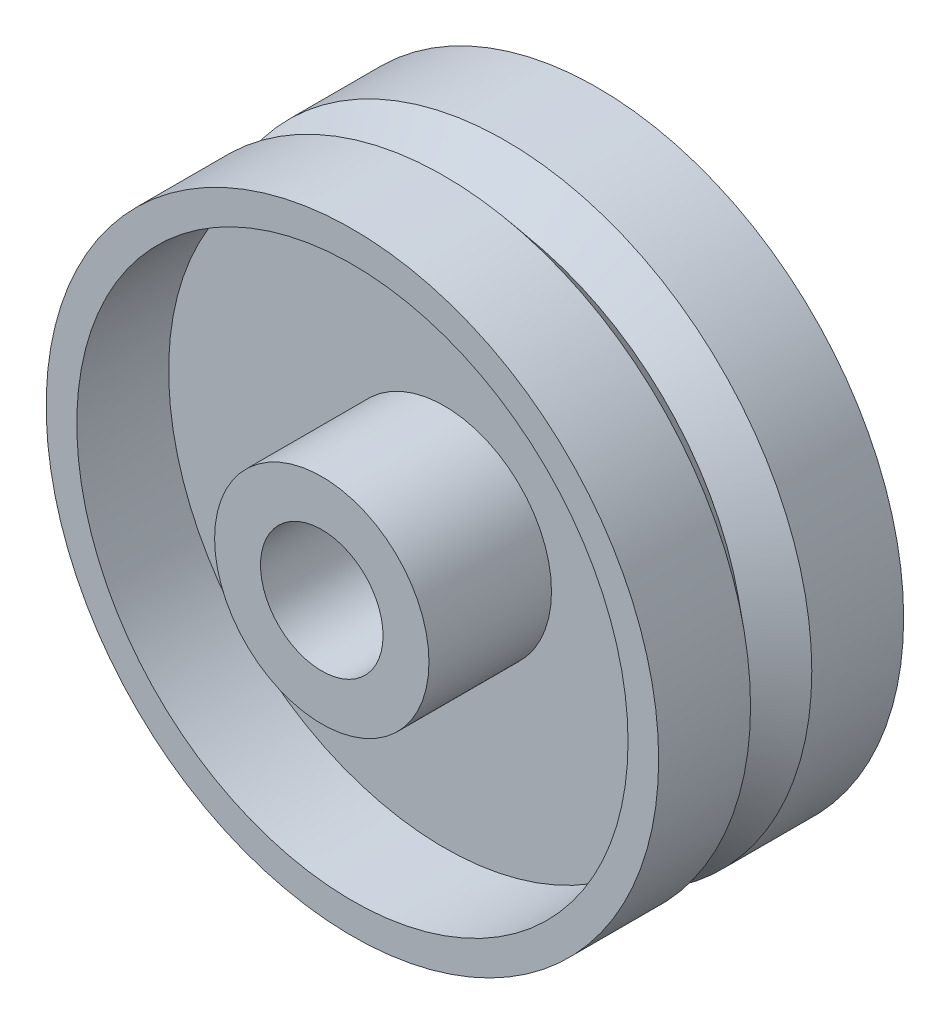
from build123d import *


with BuildPart() as part:
    # Sketch1 → Revolve1 (revolve)
    with BuildSketch(Plane(origin=(0, 0, 0), x_dir=(0, 0, -1), z_dir=(1, 0, 0)), mode=Mode.PRIVATE) as revolve1_sk:
        Polygon((-25, 10), (25, 10), (25, 17.5), (5, 17.5), (5, 45), (20, 45), (20, 50), (-20, 50), (-20, 45), (-5, 45), (-5, 17.5), (-25, 17.5), align=None)
    revolve(revolve1_sk.sketch.rotate(Axis((0, 0, 0), (0, 0, -1)), 90), axis=Axis((0, 0, 0), (0, 0, -1)))

    # Sketch2 → Cut-Revolve1 (revolve, cut)
    with BuildSketch(Plane(origin=(0, 0, 0), x_dir=(0, 0, -1), z_dir=(1, 0, 0)), mode=Mode.PRIVATE) as cut_revolve1_sk:
        Polygon((-5, 50), (5, 50), (0, 44.041232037), align=None)
    revolve(cut_revolve1_sk.sketch.rotate(Axis((0, 0, 0), (0, 0, -1)), 90), axis=Axis((0, 0, 0), (0, 0, -1)), mode=Mode.SUBTRACT)


solid = part.part
